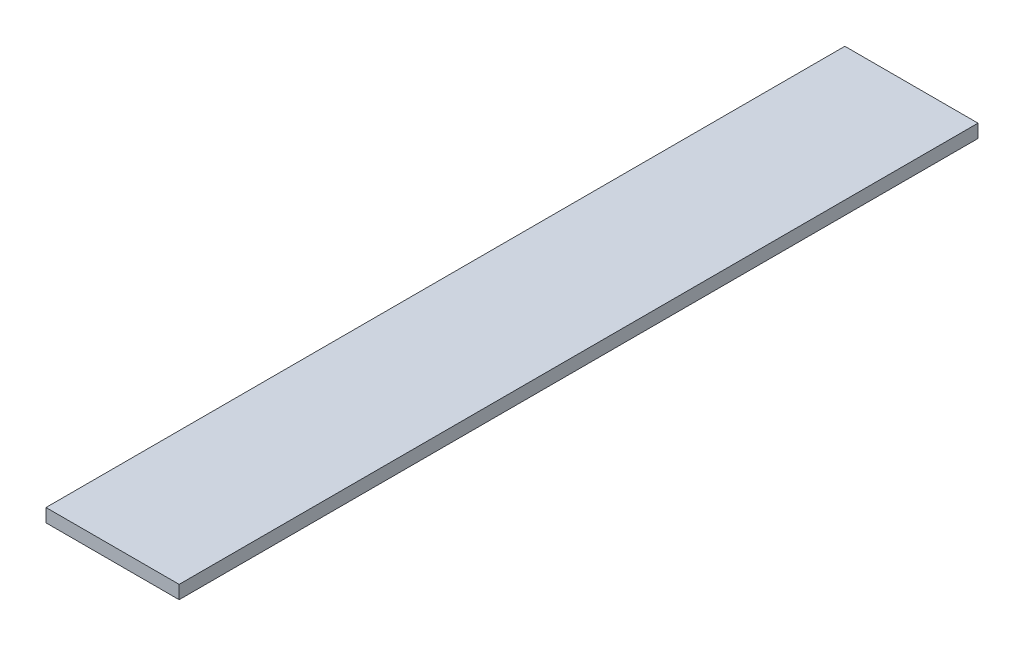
ISO-10303-21;
HEADER;
FILE_DESCRIPTION(('STEP AP214'),'2;1');
FILE_NAME('part.step','',(''),(''),'','','');
FILE_SCHEMA(('AUTOMOTIVE_DESIGN { 1 0 10303 214 1 1 1 1 }'));
ENDSEC;
DATA;
#1=APPLICATION_CONTEXT('core data for automotive mechanical design processes');
#2=APPLICATION_PROTOCOL_DEFINITION('international standard','automotive_design',2000,#1);
#3=PRODUCT_CONTEXT('',#1,'mechanical');
#4=PRODUCT('Part','Part','',(#3));
#5=PRODUCT_RELATED_PRODUCT_CATEGORY('part','',(#4));
#6=PRODUCT_DEFINITION_FORMATION('','',#4);
#7=PRODUCT_DEFINITION_CONTEXT('part definition',#1,'design');
#8=PRODUCT_DEFINITION('design','',#6,#7);
#9=PRODUCT_DEFINITION_SHAPE('','',#8);
#10=(LENGTH_UNIT() NAMED_UNIT(*) SI_UNIT(.MILLI.,.METRE.));
#11=(NAMED_UNIT(*) PLANE_ANGLE_UNIT() SI_UNIT($,.RADIAN.));
#12=(NAMED_UNIT(*) SI_UNIT($,.STERADIAN.) SOLID_ANGLE_UNIT());
#13=UNCERTAINTY_MEASURE_WITH_UNIT(LENGTH_MEASURE(1.E-05),#10,'distance_accuracy_value','');
#14=(GEOMETRIC_REPRESENTATION_CONTEXT(3) GLOBAL_UNCERTAINTY_ASSIGNED_CONTEXT((#13)) GLOBAL_UNIT_ASSIGNED_CONTEXT((#10,
#11,#12)) REPRESENTATION_CONTEXT('',''));
#15=CARTESIAN_POINT('',(0.,0.,0.));
#16=DIRECTION('',(0.,0.,1.));
#17=DIRECTION('',(1.,0.,0.));
#18=AXIS2_PLACEMENT_3D('',#15,#16,#17);
#19=CARTESIAN_POINT('',(0.,0.,300.));
#20=DIRECTION('',(1.,0.,0.));
#21=DIRECTION('',(0.,1.,0.));
#22=AXIS2_PLACEMENT_3D('',#19,#20,#21);
#23=PLANE('',#22);
#24=DIRECTION('',(0.,-1.,0.));
#25=VECTOR('',#24,1.);
#26=CARTESIAN_POINT('',(0.,0.,0.));
#27=LINE('',#26,#25);
#28=CARTESIAN_POINT('',(0.,0.,0.));
#29=VERTEX_POINT('',#28);
#30=CARTESIAN_POINT('',(0.,-5.,0.));
#31=VERTEX_POINT('',#30);
#32=EDGE_CURVE('E73',#29,#31,#27,.T.);
#33=ORIENTED_EDGE('',*,*,#32,.T.);
#34=DIRECTION('',(0.,0.,-1.));
#35=VECTOR('',#34,1.);
#36=CARTESIAN_POINT('',(0.,-5.,300.));
#37=LINE('',#36,#35);
#38=CARTESIAN_POINT('',(0.,-5.,300.));
#39=VERTEX_POINT('',#38);
#40=EDGE_CURVE('E11',#39,#31,#37,.T.);
#41=ORIENTED_EDGE('',*,*,#40,.F.);
#42=DIRECTION('',(0.,-1.,0.));
#43=VECTOR('',#42,1.);
#44=CARTESIAN_POINT('',(0.,0.,300.));
#45=LINE('',#44,#43);
#46=CARTESIAN_POINT('',(0.,0.,300.));
#47=VERTEX_POINT('',#46);
#48=EDGE_CURVE('E91',#47,#39,#45,.T.);
#49=ORIENTED_EDGE('',*,*,#48,.F.);
#50=DIRECTION('',(0.,0.,-1.));
#51=VECTOR('',#50,1.);
#52=CARTESIAN_POINT('',(0.,0.,300.));
#53=LINE('',#52,#51);
#54=EDGE_CURVE('E85',#47,#29,#53,.T.);
#55=ORIENTED_EDGE('',*,*,#54,.T.);
#56=EDGE_LOOP('',(#33,#41,#49,#55));
#57=FACE_BOUND('',#56,.T.);
#58=ADVANCED_FACE('F29',(#57),#23,.F.);
#59=CARTESIAN_POINT('',(0.,-5.,300.));
#60=DIRECTION('',(0.,1.,0.));
#61=DIRECTION('',(0.,0.,1.));
#62=AXIS2_PLACEMENT_3D('',#59,#60,#61);
#63=PLANE('',#62);
#64=DIRECTION('',(1.,0.,0.));
#65=VECTOR('',#64,1.);
#66=CARTESIAN_POINT('',(0.,-5.,0.));
#67=LINE('',#66,#65);
#68=CARTESIAN_POINT('',(50.,-5.,0.));
#69=VERTEX_POINT('',#68);
#70=EDGE_CURVE('E69',#31,#69,#67,.T.);
#71=ORIENTED_EDGE('',*,*,#70,.T.);
#72=DIRECTION('',(0.,0.,-1.));
#73=VECTOR('',#72,1.);
#74=CARTESIAN_POINT('',(50.,-5.,300.));
#75=LINE('',#74,#73);
#76=CARTESIAN_POINT('',(50.,-5.,300.));
#77=VERTEX_POINT('',#76);
#78=EDGE_CURVE('E36',#77,#69,#75,.T.);
#79=ORIENTED_EDGE('',*,*,#78,.F.);
#80=DIRECTION('',(1.,0.,0.));
#81=VECTOR('',#80,1.);
#82=CARTESIAN_POINT('',(0.,-5.,300.));
#83=LINE('',#82,#81);
#84=EDGE_CURVE('E81',#39,#77,#83,.T.);
#85=ORIENTED_EDGE('',*,*,#84,.F.);
#86=ORIENTED_EDGE('',*,*,#40,.T.);
#87=EDGE_LOOP('',(#71,#79,#85,#86));
#88=FACE_BOUND('',#87,.T.);
#89=ADVANCED_FACE('F80',(#88),#63,.F.);
#90=CARTESIAN_POINT('',(50.,0.,300.));
#91=DIRECTION('',(-1.,0.,0.));
#92=DIRECTION('',(0.,-1.,0.));
#93=AXIS2_PLACEMENT_3D('',#90,#91,#92);
#94=PLANE('',#93);
#95=DIRECTION('',(0.,1.,0.));
#96=VECTOR('',#95,1.);
#97=CARTESIAN_POINT('',(50.,0.,0.));
#98=LINE('',#97,#96);
#99=CARTESIAN_POINT('',(50.,0.,0.));
#100=VERTEX_POINT('',#99);
#101=EDGE_CURVE('E74',#69,#100,#98,.T.);
#102=ORIENTED_EDGE('',*,*,#101,.T.);
#103=DIRECTION('',(0.,0.,-1.));
#104=VECTOR('',#103,1.);
#105=CARTESIAN_POINT('',(50.,0.,300.));
#106=LINE('',#105,#104);
#107=CARTESIAN_POINT('',(50.,0.,300.));
#108=VERTEX_POINT('',#107);
#109=EDGE_CURVE('E97',#108,#100,#106,.T.);
#110=ORIENTED_EDGE('',*,*,#109,.F.);
#111=DIRECTION('',(0.,1.,0.));
#112=VECTOR('',#111,1.);
#113=CARTESIAN_POINT('',(50.,0.,300.));
#114=LINE('',#113,#112);
#115=EDGE_CURVE('E48',#77,#108,#114,.T.);
#116=ORIENTED_EDGE('',*,*,#115,.F.);
#117=ORIENTED_EDGE('',*,*,#78,.T.);
#118=EDGE_LOOP('',(#102,#110,#116,#117));
#119=FACE_BOUND('',#118,.T.);
#120=ADVANCED_FACE('F100',(#119),#94,.F.);
#121=CARTESIAN_POINT('',(0.,0.,300.));
#122=DIRECTION('',(0.,-1.,0.));
#123=DIRECTION('',(0.,0.,-1.));
#124=AXIS2_PLACEMENT_3D('',#121,#122,#123);
#125=PLANE('',#124);
#126=DIRECTION('',(-1.,0.,0.));
#127=VECTOR('',#126,1.);
#128=CARTESIAN_POINT('',(0.,0.,0.));
#129=LINE('',#128,#127);
#130=EDGE_CURVE('E89',#100,#29,#129,.T.);
#131=ORIENTED_EDGE('',*,*,#130,.T.);
#132=ORIENTED_EDGE('',*,*,#54,.F.);
#133=DIRECTION('',(-1.,0.,0.));
#134=VECTOR('',#133,1.);
#135=CARTESIAN_POINT('',(0.,0.,300.));
#136=LINE('',#135,#134);
#137=EDGE_CURVE('E43',#108,#47,#136,.T.);
#138=ORIENTED_EDGE('',*,*,#137,.F.);
#139=ORIENTED_EDGE('',*,*,#109,.T.);
#140=EDGE_LOOP('',(#131,#132,#138,#139));
#141=FACE_BOUND('',#140,.T.);
#142=ADVANCED_FACE('F102',(#141),#125,.F.);
#143=CARTESIAN_POINT('',(0.,-5.,300.));
#144=DIRECTION('',(0.,0.,1.));
#145=DIRECTION('',(1.,0.,0.));
#146=AXIS2_PLACEMENT_3D('',#143,#144,#145);
#147=PLANE('',#146);
#148=ORIENTED_EDGE('',*,*,#48,.T.);
#149=ORIENTED_EDGE('',*,*,#84,.T.);
#150=ORIENTED_EDGE('',*,*,#115,.T.);
#151=ORIENTED_EDGE('',*,*,#137,.T.);
#152=EDGE_LOOP('',(#148,#149,#150,#151));
#153=FACE_BOUND('',#152,.T.);
#154=ADVANCED_FACE('F103',(#153),#147,.T.);
#155=CARTESIAN_POINT('',(0.,-5.,0.));
#156=DIRECTION('',(0.,0.,1.));
#157=DIRECTION('',(1.,0.,0.));
#158=AXIS2_PLACEMENT_3D('',#155,#156,#157);
#159=PLANE('',#158);
#160=ORIENTED_EDGE('',*,*,#32,.F.);
#161=ORIENTED_EDGE('',*,*,#130,.F.);
#162=ORIENTED_EDGE('',*,*,#101,.F.);
#163=ORIENTED_EDGE('',*,*,#70,.F.);
#164=EDGE_LOOP('',(#160,#161,#162,#163));
#165=FACE_BOUND('',#164,.T.);
#166=ADVANCED_FACE('F70',(#165),#159,.F.);
#167=CLOSED_SHELL('',(#58,#89,#120,#142,#154,#166));
#168=MANIFOLD_SOLID_BREP('B2',#167);
#169=ADVANCED_BREP_SHAPE_REPRESENTATION('',(#18,#168),#14);
#170=SHAPE_DEFINITION_REPRESENTATION(#9,#169);
ENDSEC;
END-ISO-10303-21;
